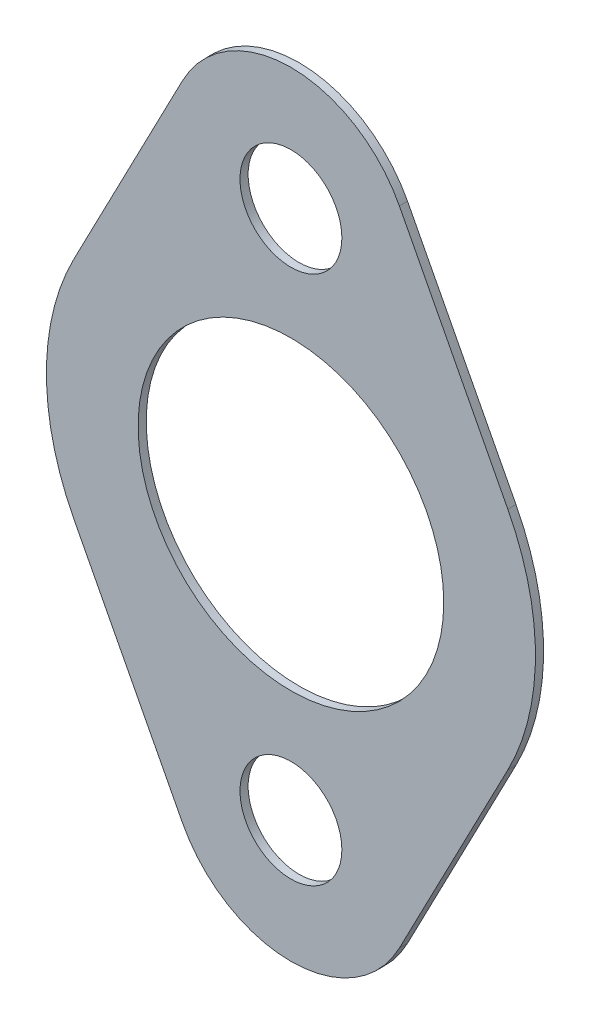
ISO-10303-21;
HEADER;
FILE_DESCRIPTION(('STEP AP214'),'2;1');
FILE_NAME('part.step','',(''),(''),'','','');
FILE_SCHEMA(('AUTOMOTIVE_DESIGN { 1 0 10303 214 1 1 1 1 }'));
ENDSEC;
DATA;
#1=APPLICATION_CONTEXT('core data for automotive mechanical design processes');
#2=APPLICATION_PROTOCOL_DEFINITION('international standard','automotive_design',2000,#1);
#3=PRODUCT_CONTEXT('',#1,'mechanical');
#4=PRODUCT('Part','Part','',(#3));
#5=PRODUCT_RELATED_PRODUCT_CATEGORY('part','',(#4));
#6=PRODUCT_DEFINITION_FORMATION('','',#4);
#7=PRODUCT_DEFINITION_CONTEXT('part definition',#1,'design');
#8=PRODUCT_DEFINITION('design','',#6,#7);
#9=PRODUCT_DEFINITION_SHAPE('','',#8);
#10=(LENGTH_UNIT() NAMED_UNIT(*) SI_UNIT(.MILLI.,.METRE.));
#11=(NAMED_UNIT(*) PLANE_ANGLE_UNIT() SI_UNIT($,.RADIAN.));
#12=(NAMED_UNIT(*) SI_UNIT($,.STERADIAN.) SOLID_ANGLE_UNIT());
#13=UNCERTAINTY_MEASURE_WITH_UNIT(LENGTH_MEASURE(1.E-05),#10,'distance_accuracy_value','');
#14=(GEOMETRIC_REPRESENTATION_CONTEXT(3) GLOBAL_UNCERTAINTY_ASSIGNED_CONTEXT((#13)) GLOBAL_UNIT_ASSIGNED_CONTEXT((#10,
#11,#12)) REPRESENTATION_CONTEXT('',''));
#15=CARTESIAN_POINT('',(0.,0.,0.));
#16=DIRECTION('',(0.,0.,1.));
#17=DIRECTION('',(1.,0.,0.));
#18=AXIS2_PLACEMENT_3D('',#15,#16,#17);
#19=CARTESIAN_POINT('',(0.,65.,2.));
#20=DIRECTION('',(0.,0.,-1.));
#21=DIRECTION('',(-1.,0.,0.));
#22=AXIS2_PLACEMENT_3D('',#19,#20,#21);
#23=CYLINDRICAL_SURFACE('',#22,30.);
#24=CARTESIAN_POINT('',(0.,65.,0.));
#25=DIRECTION('',(0.,0.,-1.));
#26=DIRECTION('',(-1.,0.,0.));
#27=AXIS2_PLACEMENT_3D('',#24,#25,#26);
#28=CIRCLE('',#27,30.);
#29=CARTESIAN_POINT('',(-26.6136059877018,78.8461538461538,0.));
#30=VERTEX_POINT('',#29);
#31=CARTESIAN_POINT('',(26.6136059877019,78.8461538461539,0.));
#32=VERTEX_POINT('',#31);
#33=EDGE_CURVE('E137',#30,#32,#28,.T.);
#34=ORIENTED_EDGE('',*,*,#33,.F.);
#35=DIRECTION('',(0.,0.,-1.));
#36=VECTOR('',#35,1.);
#37=CARTESIAN_POINT('',(-26.6136059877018,78.8461538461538,2.));
#38=LINE('',#37,#36);
#39=CARTESIAN_POINT('',(-26.6136059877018,78.8461538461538,2.));
#40=VERTEX_POINT('',#39);
#41=EDGE_CURVE('E11',#40,#30,#38,.T.);
#42=ORIENTED_EDGE('',*,*,#41,.F.);
#43=CARTESIAN_POINT('',(0.,65.,2.));
#44=DIRECTION('',(0.,0.,-1.));
#45=DIRECTION('',(-1.,0.,0.));
#46=AXIS2_PLACEMENT_3D('',#43,#44,#45);
#47=CIRCLE('',#46,30.);
#48=CARTESIAN_POINT('',(26.6136059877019,78.8461538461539,2.));
#49=VERTEX_POINT('',#48);
#50=EDGE_CURVE('E154',#40,#49,#47,.T.);
#51=ORIENTED_EDGE('',*,*,#50,.T.);
#52=DIRECTION('',(0.,0.,-1.));
#53=VECTOR('',#52,1.);
#54=CARTESIAN_POINT('',(26.6136059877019,78.8461538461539,2.));
#55=LINE('',#54,#53);
#56=EDGE_CURVE('E45',#49,#32,#55,.T.);
#57=ORIENTED_EDGE('',*,*,#56,.T.);
#58=EDGE_LOOP('',(#34,#42,#51,#57));
#59=FACE_BOUND('',#58,.T.);
#60=ADVANCED_FACE('F39',(#59),#23,.T.);
#61=CARTESIAN_POINT('',(-26.6136059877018,78.8461538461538,2.));
#62=DIRECTION('',(0.887120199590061,-0.461538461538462,0.));
#63=DIRECTION('',(0.461538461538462,0.887120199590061,0.));
#64=AXIS2_PLACEMENT_3D('',#61,#62,#63);
#65=PLANE('',#64);
#66=DIRECTION('',(-0.461538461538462,-0.887120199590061,0.));
#67=VECTOR('',#66,1.);
#68=CARTESIAN_POINT('',(-26.6136059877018,78.8461538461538,0.));
#69=LINE('',#68,#67);
#70=CARTESIAN_POINT('',(-53.2272119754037,27.6923076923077,0.));
#71=VERTEX_POINT('',#70);
#72=EDGE_CURVE('E155',#30,#71,#69,.T.);
#73=ORIENTED_EDGE('',*,*,#72,.T.);
#74=DIRECTION('',(0.,0.,-1.));
#75=VECTOR('',#74,1.);
#76=CARTESIAN_POINT('',(-53.2272119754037,27.6923076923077,2.));
#77=LINE('',#76,#75);
#78=CARTESIAN_POINT('',(-53.2272119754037,27.6923076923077,2.));
#79=VERTEX_POINT('',#78);
#80=EDGE_CURVE('E48',#79,#71,#77,.T.);
#81=ORIENTED_EDGE('',*,*,#80,.F.);
#82=DIRECTION('',(-0.461538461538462,-0.887120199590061,0.));
#83=VECTOR('',#82,1.);
#84=CARTESIAN_POINT('',(-26.6136059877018,78.8461538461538,2.));
#85=LINE('',#84,#83);
#86=EDGE_CURVE('E123',#40,#79,#85,.T.);
#87=ORIENTED_EDGE('',*,*,#86,.F.);
#88=ORIENTED_EDGE('',*,*,#41,.T.);
#89=EDGE_LOOP('',(#73,#81,#87,#88));
#90=FACE_BOUND('',#89,.T.);
#91=ADVANCED_FACE('F168',(#90),#65,.F.);
#92=CARTESIAN_POINT('',(0.,0.,2.));
#93=DIRECTION('',(0.,0.,-1.));
#94=DIRECTION('',(-1.,0.,0.));
#95=AXIS2_PLACEMENT_3D('',#92,#93,#94);
#96=CYLINDRICAL_SURFACE('',#95,60.);
#97=CARTESIAN_POINT('',(0.,0.,0.));
#98=DIRECTION('',(0.,0.,-1.));
#99=DIRECTION('',(-1.,0.,0.));
#100=AXIS2_PLACEMENT_3D('',#97,#98,#99);
#101=CIRCLE('',#100,60.);
#102=CARTESIAN_POINT('',(-53.2272119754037,-27.6923076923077,0.));
#103=VERTEX_POINT('',#102);
#104=EDGE_CURVE('E112',#103,#71,#101,.T.);
#105=ORIENTED_EDGE('',*,*,#104,.F.);
#106=DIRECTION('',(0.,0.,-1.));
#107=VECTOR('',#106,1.);
#108=CARTESIAN_POINT('',(-53.2272119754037,-27.6923076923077,2.));
#109=LINE('',#108,#107);
#110=CARTESIAN_POINT('',(-53.2272119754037,-27.6923076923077,2.));
#111=VERTEX_POINT('',#110);
#112=EDGE_CURVE('E108',#111,#103,#109,.T.);
#113=ORIENTED_EDGE('',*,*,#112,.F.);
#114=CARTESIAN_POINT('',(0.,0.,2.));
#115=DIRECTION('',(0.,0.,-1.));
#116=DIRECTION('',(-1.,0.,0.));
#117=AXIS2_PLACEMENT_3D('',#114,#115,#116);
#118=CIRCLE('',#117,60.);
#119=EDGE_CURVE('E111',#111,#79,#118,.T.);
#120=ORIENTED_EDGE('',*,*,#119,.T.);
#121=ORIENTED_EDGE('',*,*,#80,.T.);
#122=EDGE_LOOP('',(#105,#113,#120,#121));
#123=FACE_BOUND('',#122,.T.);
#124=ADVANCED_FACE('F109',(#123),#96,.T.);
#125=CARTESIAN_POINT('',(-26.6136059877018,-78.8461538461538,2.));
#126=DIRECTION('',(-0.887120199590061,-0.461538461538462,0.));
#127=DIRECTION('',(0.461538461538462,-0.887120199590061,0.));
#128=AXIS2_PLACEMENT_3D('',#125,#126,#127);
#129=PLANE('',#128);
#130=DIRECTION('',(-0.461538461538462,0.887120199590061,0.));
#131=VECTOR('',#130,1.);
#132=CARTESIAN_POINT('',(-26.6136059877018,-78.8461538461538,0.));
#133=LINE('',#132,#131);
#134=CARTESIAN_POINT('',(-26.6136059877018,-78.8461538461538,0.));
#135=VERTEX_POINT('',#134);
#136=EDGE_CURVE('E153',#135,#103,#133,.T.);
#137=ORIENTED_EDGE('',*,*,#136,.F.);
#138=DIRECTION('',(0.,0.,-1.));
#139=VECTOR('',#138,1.);
#140=CARTESIAN_POINT('',(-26.6136059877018,-78.8461538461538,2.));
#141=LINE('',#140,#139);
#142=CARTESIAN_POINT('',(-26.6136059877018,-78.8461538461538,2.));
#143=VERTEX_POINT('',#142);
#144=EDGE_CURVE('E119',#143,#135,#141,.T.);
#145=ORIENTED_EDGE('',*,*,#144,.F.);
#146=DIRECTION('',(-0.461538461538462,0.887120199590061,0.));
#147=VECTOR('',#146,1.);
#148=CARTESIAN_POINT('',(-26.6136059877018,-78.8461538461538,2.));
#149=LINE('',#148,#147);
#150=EDGE_CURVE('E121',#143,#111,#149,.T.);
#151=ORIENTED_EDGE('',*,*,#150,.T.);
#152=ORIENTED_EDGE('',*,*,#112,.T.);
#153=EDGE_LOOP('',(#137,#145,#151,#152));
#154=FACE_BOUND('',#153,.T.);
#155=ADVANCED_FACE('F130',(#154),#129,.T.);
#156=CARTESIAN_POINT('',(0.,-65.,2.));
#157=DIRECTION('',(0.,0.,-1.));
#158=DIRECTION('',(-1.,0.,0.));
#159=AXIS2_PLACEMENT_3D('',#156,#157,#158);
#160=CYLINDRICAL_SURFACE('',#159,30.);
#161=CARTESIAN_POINT('',(0.,-65.,0.));
#162=DIRECTION('',(0.,0.,1.));
#163=DIRECTION('',(1.,0.,0.));
#164=AXIS2_PLACEMENT_3D('',#161,#162,#163);
#165=CIRCLE('',#164,30.);
#166=CARTESIAN_POINT('',(26.6136059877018,-78.8461538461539,0.));
#167=VERTEX_POINT('',#166);
#168=EDGE_CURVE('E149',#135,#167,#165,.T.);
#169=ORIENTED_EDGE('',*,*,#168,.T.);
#170=DIRECTION('',(0.,0.,-1.));
#171=VECTOR('',#170,1.);
#172=CARTESIAN_POINT('',(26.6136059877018,-78.8461538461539,2.));
#173=LINE('',#172,#171);
#174=CARTESIAN_POINT('',(26.6136059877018,-78.8461538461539,2.));
#175=VERTEX_POINT('',#174);
#176=EDGE_CURVE('E159',#175,#167,#173,.T.);
#177=ORIENTED_EDGE('',*,*,#176,.F.);
#178=CARTESIAN_POINT('',(0.,-65.,2.));
#179=DIRECTION('',(0.,0.,1.));
#180=DIRECTION('',(1.,0.,0.));
#181=AXIS2_PLACEMENT_3D('',#178,#179,#180);
#182=CIRCLE('',#181,30.);
#183=EDGE_CURVE('E126',#143,#175,#182,.T.);
#184=ORIENTED_EDGE('',*,*,#183,.F.);
#185=ORIENTED_EDGE('',*,*,#144,.T.);
#186=EDGE_LOOP('',(#169,#177,#184,#185));
#187=FACE_BOUND('',#186,.T.);
#188=ADVANCED_FACE('F186',(#187),#160,.T.);
#189=CARTESIAN_POINT('',(26.6136059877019,-78.8461538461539,2.));
#190=DIRECTION('',(-0.887120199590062,0.461538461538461,0.));
#191=DIRECTION('',(-0.461538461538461,-0.887120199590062,0.));
#192=AXIS2_PLACEMENT_3D('',#189,#190,#191);
#193=PLANE('',#192);
#194=DIRECTION('',(0.46153846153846,0.887120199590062,0.));
#195=VECTOR('',#194,1.);
#196=CARTESIAN_POINT('',(26.6136059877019,-78.8461538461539,0.));
#197=LINE('',#196,#195);
#198=CARTESIAN_POINT('',(53.2272119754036,-27.6923076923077,0.));
#199=VERTEX_POINT('',#198);
#200=EDGE_CURVE('E147',#167,#199,#197,.T.);
#201=ORIENTED_EDGE('',*,*,#200,.T.);
#202=DIRECTION('',(0.,0.,-1.));
#203=VECTOR('',#202,1.);
#204=CARTESIAN_POINT('',(53.2272119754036,-27.6923076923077,2.));
#205=LINE('',#204,#203);
#206=CARTESIAN_POINT('',(53.2272119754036,-27.6923076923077,2.));
#207=VERTEX_POINT('',#206);
#208=EDGE_CURVE('E165',#207,#199,#205,.T.);
#209=ORIENTED_EDGE('',*,*,#208,.F.);
#210=DIRECTION('',(0.46153846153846,0.887120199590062,0.));
#211=VECTOR('',#210,1.);
#212=CARTESIAN_POINT('',(26.6136059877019,-78.8461538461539,2.));
#213=LINE('',#212,#211);
#214=EDGE_CURVE('E131',#175,#207,#213,.T.);
#215=ORIENTED_EDGE('',*,*,#214,.F.);
#216=ORIENTED_EDGE('',*,*,#176,.T.);
#217=EDGE_LOOP('',(#201,#209,#215,#216));
#218=FACE_BOUND('',#217,.T.);
#219=ADVANCED_FACE('F184',(#218),#193,.F.);
#220=CARTESIAN_POINT('',(0.,0.,2.));
#221=DIRECTION('',(0.,0.,-1.));
#222=DIRECTION('',(-1.,0.,0.));
#223=AXIS2_PLACEMENT_3D('',#220,#221,#222);
#224=CYLINDRICAL_SURFACE('',#223,60.);
#225=CARTESIAN_POINT('',(0.,0.,0.));
#226=DIRECTION('',(0.,0.,-1.));
#227=DIRECTION('',(-1.,0.,0.));
#228=AXIS2_PLACEMENT_3D('',#225,#226,#227);
#229=CIRCLE('',#228,60.);
#230=CARTESIAN_POINT('',(53.2272119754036,27.6923076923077,0.));
#231=VERTEX_POINT('',#230);
#232=EDGE_CURVE('E143',#231,#199,#229,.T.);
#233=ORIENTED_EDGE('',*,*,#232,.F.);
#234=DIRECTION('',(0.,0.,-1.));
#235=VECTOR('',#234,1.);
#236=CARTESIAN_POINT('',(53.2272119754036,27.6923076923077,2.));
#237=LINE('',#236,#235);
#238=CARTESIAN_POINT('',(53.2272119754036,27.6923076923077,2.));
#239=VERTEX_POINT('',#238);
#240=EDGE_CURVE('E163',#239,#231,#237,.T.);
#241=ORIENTED_EDGE('',*,*,#240,.F.);
#242=CARTESIAN_POINT('',(0.,0.,2.));
#243=DIRECTION('',(0.,0.,-1.));
#244=DIRECTION('',(-1.,0.,0.));
#245=AXIS2_PLACEMENT_3D('',#242,#243,#244);
#246=CIRCLE('',#245,60.);
#247=EDGE_CURVE('E175',#239,#207,#246,.T.);
#248=ORIENTED_EDGE('',*,*,#247,.T.);
#249=ORIENTED_EDGE('',*,*,#208,.T.);
#250=EDGE_LOOP('',(#233,#241,#248,#249));
#251=FACE_BOUND('',#250,.T.);
#252=ADVANCED_FACE('F187',(#251),#224,.T.);
#253=CARTESIAN_POINT('',(26.6136059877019,78.8461538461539,2.));
#254=DIRECTION('',(0.887120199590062,0.461538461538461,0.));
#255=DIRECTION('',(-0.461538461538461,0.887120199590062,0.));
#256=AXIS2_PLACEMENT_3D('',#253,#254,#255);
#257=PLANE('',#256);
#258=DIRECTION('',(0.46153846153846,-0.887120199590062,0.));
#259=VECTOR('',#258,1.);
#260=CARTESIAN_POINT('',(26.6136059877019,78.8461538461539,0.));
#261=LINE('',#260,#259);
#262=EDGE_CURVE('E139',#32,#231,#261,.T.);
#263=ORIENTED_EDGE('',*,*,#262,.F.);
#264=ORIENTED_EDGE('',*,*,#56,.F.);
#265=DIRECTION('',(0.46153846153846,-0.887120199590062,0.));
#266=VECTOR('',#265,1.);
#267=CARTESIAN_POINT('',(26.6136059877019,78.8461538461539,2.));
#268=LINE('',#267,#266);
#269=EDGE_CURVE('E169',#49,#239,#268,.T.);
#270=ORIENTED_EDGE('',*,*,#269,.T.);
#271=ORIENTED_EDGE('',*,*,#240,.T.);
#272=EDGE_LOOP('',(#263,#264,#270,#271));
#273=FACE_BOUND('',#272,.T.);
#274=ADVANCED_FACE('F164',(#273),#257,.T.);
#275=CARTESIAN_POINT('',(0.,65.,2.));
#276=DIRECTION('',(0.,0.,-1.));
#277=DIRECTION('',(-1.,0.,0.));
#278=AXIS2_PLACEMENT_3D('',#275,#276,#277);
#279=PLANE('',#278);
#280=CARTESIAN_POINT('',(0.,0.,2.));
#281=DIRECTION('',(0.,0.,1.));
#282=DIRECTION('',(1.,0.,0.));
#283=AXIS2_PLACEMENT_3D('',#280,#281,#282);
#284=CIRCLE('',#283,37.5);
#285=CARTESIAN_POINT('',(37.5,0.,2.));
#286=VERTEX_POINT('',#285);
#287=EDGE_CURVE('E232',#286,#286,#284,.T.);
#288=ORIENTED_EDGE('',*,*,#287,.F.);
#289=EDGE_LOOP('',(#288));
#290=FACE_BOUND('',#289,.T.);
#291=CARTESIAN_POINT('',(0.,-65.,2.));
#292=DIRECTION('',(0.,0.,1.));
#293=DIRECTION('',(1.,0.,0.));
#294=AXIS2_PLACEMENT_3D('',#291,#292,#293);
#295=CIRCLE('',#294,12.5);
#296=CARTESIAN_POINT('',(12.5,-65.,2.));
#297=VERTEX_POINT('',#296);
#298=EDGE_CURVE('E234',#297,#297,#295,.T.);
#299=ORIENTED_EDGE('',*,*,#298,.F.);
#300=EDGE_LOOP('',(#299));
#301=FACE_BOUND('',#300,.T.);
#302=CARTESIAN_POINT('',(0.,65.,2.));
#303=DIRECTION('',(0.,0.,1.));
#304=DIRECTION('',(1.,0.,0.));
#305=AXIS2_PLACEMENT_3D('',#302,#303,#304);
#306=CIRCLE('',#305,12.5);
#307=CARTESIAN_POINT('',(12.5,65.,2.));
#308=VERTEX_POINT('',#307);
#309=EDGE_CURVE('E174',#308,#308,#306,.T.);
#310=ORIENTED_EDGE('',*,*,#309,.F.);
#311=EDGE_LOOP('',(#310));
#312=FACE_BOUND('',#311,.T.);
#313=ORIENTED_EDGE('',*,*,#50,.F.);
#314=ORIENTED_EDGE('',*,*,#86,.T.);
#315=ORIENTED_EDGE('',*,*,#119,.F.);
#316=ORIENTED_EDGE('',*,*,#150,.F.);
#317=ORIENTED_EDGE('',*,*,#183,.T.);
#318=ORIENTED_EDGE('',*,*,#214,.T.);
#319=ORIENTED_EDGE('',*,*,#247,.F.);
#320=ORIENTED_EDGE('',*,*,#269,.F.);
#321=EDGE_LOOP('',(#313,#314,#315,#316,#317,#318,#319,#320));
#322=FACE_BOUND('',#321,.T.);
#323=ADVANCED_FACE('F124',(#290,#301,#312,#322),#279,.F.);
#324=CARTESIAN_POINT('',(0.,65.,0.));
#325=DIRECTION('',(0.,0.,-1.));
#326=DIRECTION('',(-1.,0.,0.));
#327=AXIS2_PLACEMENT_3D('',#324,#325,#326);
#328=PLANE('',#327);
#329=CARTESIAN_POINT('',(0.,0.,0.));
#330=DIRECTION('',(0.,0.,1.));
#331=DIRECTION('',(1.,0.,0.));
#332=AXIS2_PLACEMENT_3D('',#329,#330,#331);
#333=CIRCLE('',#332,37.5);
#334=CARTESIAN_POINT('',(37.5,0.,0.));
#335=VERTEX_POINT('',#334);
#336=EDGE_CURVE('E229',#335,#335,#333,.T.);
#337=ORIENTED_EDGE('',*,*,#336,.T.);
#338=EDGE_LOOP('',(#337));
#339=FACE_BOUND('',#338,.T.);
#340=CARTESIAN_POINT('',(0.,-65.,0.));
#341=DIRECTION('',(0.,0.,1.));
#342=DIRECTION('',(1.,0.,0.));
#343=AXIS2_PLACEMENT_3D('',#340,#341,#342);
#344=CIRCLE('',#343,12.5);
#345=CARTESIAN_POINT('',(12.5,-65.,0.));
#346=VERTEX_POINT('',#345);
#347=EDGE_CURVE('E239',#346,#346,#344,.T.);
#348=ORIENTED_EDGE('',*,*,#347,.T.);
#349=EDGE_LOOP('',(#348));
#350=FACE_BOUND('',#349,.T.);
#351=CARTESIAN_POINT('',(0.,65.,0.));
#352=DIRECTION('',(0.,0.,1.));
#353=DIRECTION('',(1.,0.,0.));
#354=AXIS2_PLACEMENT_3D('',#351,#352,#353);
#355=CIRCLE('',#354,12.5);
#356=CARTESIAN_POINT('',(12.5,65.,0.));
#357=VERTEX_POINT('',#356);
#358=EDGE_CURVE('E138',#357,#357,#355,.T.);
#359=ORIENTED_EDGE('',*,*,#358,.T.);
#360=EDGE_LOOP('',(#359));
#361=FACE_BOUND('',#360,.T.);
#362=ORIENTED_EDGE('',*,*,#33,.T.);
#363=ORIENTED_EDGE('',*,*,#262,.T.);
#364=ORIENTED_EDGE('',*,*,#232,.T.);
#365=ORIENTED_EDGE('',*,*,#200,.F.);
#366=ORIENTED_EDGE('',*,*,#168,.F.);
#367=ORIENTED_EDGE('',*,*,#136,.T.);
#368=ORIENTED_EDGE('',*,*,#104,.T.);
#369=ORIENTED_EDGE('',*,*,#72,.F.);
#370=EDGE_LOOP('',(#362,#363,#364,#365,#366,#367,#368,#369));
#371=FACE_BOUND('',#370,.T.);
#372=ADVANCED_FACE('F170',(#339,#350,#361,#371),#328,.T.);
#373=CARTESIAN_POINT('',(0.,65.,0.));
#374=DIRECTION('',(0.,0.,1.));
#375=DIRECTION('',(1.,0.,0.));
#376=AXIS2_PLACEMENT_3D('',#373,#374,#375);
#377=CYLINDRICAL_SURFACE('',#376,12.5);
#378=ORIENTED_EDGE('',*,*,#358,.F.);
#379=EDGE_LOOP('',(#378));
#380=FACE_BOUND('',#379,.T.);
#381=ORIENTED_EDGE('',*,*,#309,.T.);
#382=EDGE_LOOP('',(#381));
#383=FACE_BOUND('',#382,.T.);
#384=ADVANCED_FACE('F206',(#380,#383),#377,.F.);
#385=CARTESIAN_POINT('',(0.,-65.,0.));
#386=DIRECTION('',(0.,0.,1.));
#387=DIRECTION('',(1.,0.,0.));
#388=AXIS2_PLACEMENT_3D('',#385,#386,#387);
#389=CYLINDRICAL_SURFACE('',#388,12.5);
#390=ORIENTED_EDGE('',*,*,#347,.F.);
#391=EDGE_LOOP('',(#390));
#392=FACE_BOUND('',#391,.T.);
#393=ORIENTED_EDGE('',*,*,#298,.T.);
#394=EDGE_LOOP('',(#393));
#395=FACE_BOUND('',#394,.T.);
#396=ADVANCED_FACE('F220',(#392,#395),#389,.F.);
#397=CARTESIAN_POINT('',(0.,0.,0.));
#398=DIRECTION('',(0.,0.,1.));
#399=DIRECTION('',(1.,0.,0.));
#400=AXIS2_PLACEMENT_3D('',#397,#398,#399);
#401=CYLINDRICAL_SURFACE('',#400,37.5);
#402=ORIENTED_EDGE('',*,*,#336,.F.);
#403=EDGE_LOOP('',(#402));
#404=FACE_BOUND('',#403,.T.);
#405=ORIENTED_EDGE('',*,*,#287,.T.);
#406=EDGE_LOOP('',(#405));
#407=FACE_BOUND('',#406,.T.);
#408=ADVANCED_FACE('F221',(#404,#407),#401,.F.);
#409=CLOSED_SHELL('',(#60,#91,#124,#155,#188,#219,#252,#274,#323,#372,#384,#396,#408));
#410=MANIFOLD_SOLID_BREP('B2',#409);
#411=ADVANCED_BREP_SHAPE_REPRESENTATION('',(#18,#410),#14);
#412=SHAPE_DEFINITION_REPRESENTATION(#9,#411);
ENDSEC;
END-ISO-10303-21;
